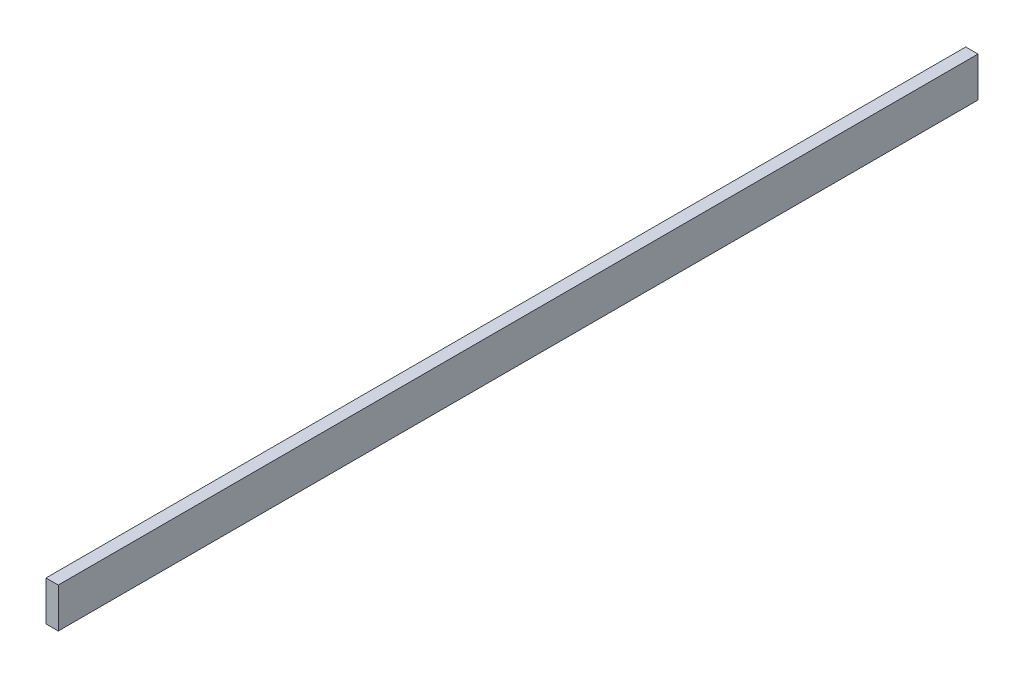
from build123d import *

# Parameters (mm, degrees)
ESQUISSE1_W      = 4
ESQUISSE1_H      = 13
EXTRUSION1_DEPTH = 150


with BuildPart() as part:
    # Esquisse1 → Extrusion1 (new, symmetric)
    with BuildSketch(Plane.XY):
        Rectangle(ESQUISSE1_W, ESQUISSE1_H)
    extrude(amount=EXTRUSION1_DEPTH, both=True)


solid = part.part
